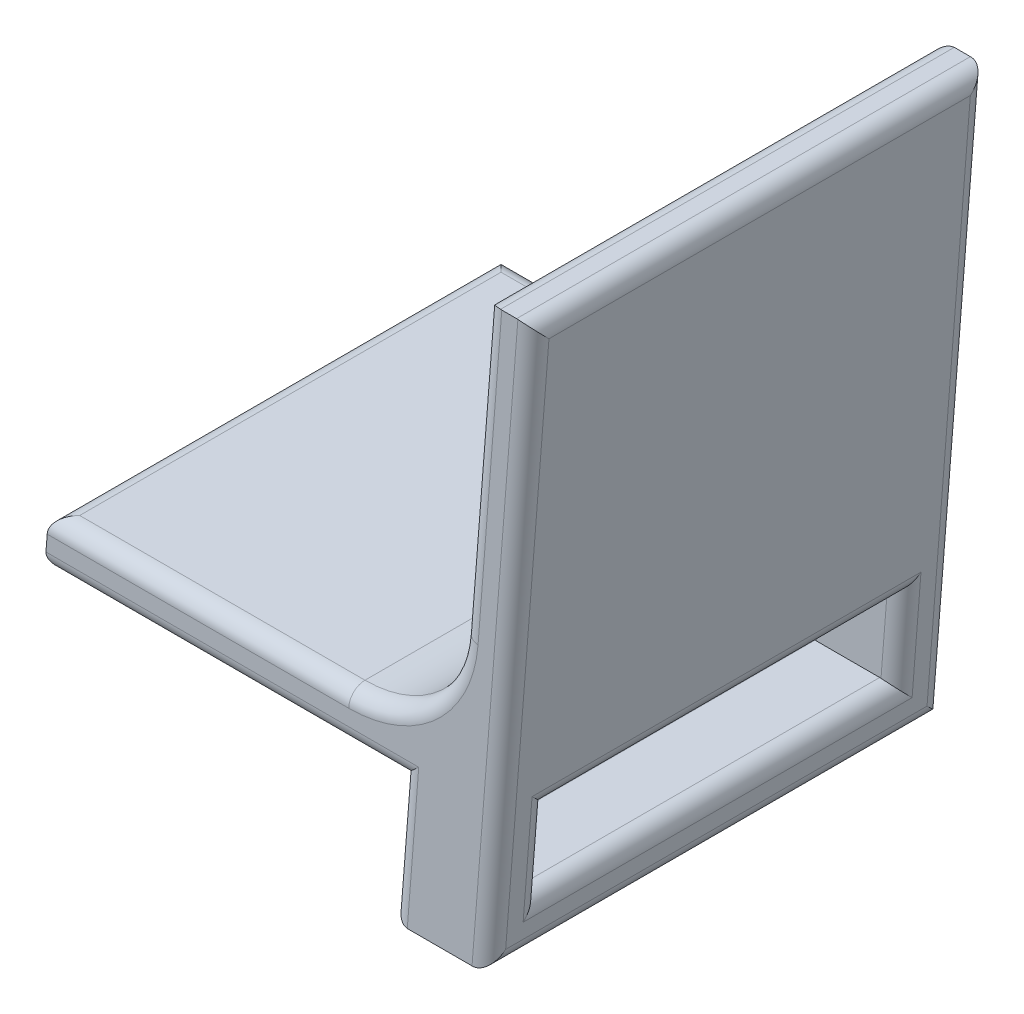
from build123d import *

# Parameters (mm, degrees)
BOSS_EXTRUDE1_DEPTH = 28
SKETCH2_W           = 22
SKETCH2_H           = 5
CUT_EXTRUDE1_DEPTH  = 48.233522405
FILLET1_R           = 7
FILLET2_R           = 1
FILLET3_R           = 1


with BuildPart() as part:
    # Sketch1 → Boss-Extrude1 (new body)
    with BuildSketch(Plane.XY):
        Polygon((0, 0), (-25, 0), (-25.235377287, -2.990752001), (-3.235377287, -2.990752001), (-3.863050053, -10.966090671), (2.136949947, -10.966090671), (3, 0), (4.967542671, 25), (1.967542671, 25), align=None)
    extrude(amount=BOSS_EXTRUDE1_DEPTH)

    # Sketch2 → Cut-Extrude1 (cut, through all, along a direction that is not the sketch's normal)
    with BuildSketch(Plane(origin=(2.981532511, -0.234651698, 0), x_dir=(0, 0, -1), z_dir=(0.9969173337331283, -0.07845909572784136, 0))):
        with Locations((-14, -5.264622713)):
            Rectangle(SKETCH2_W, SKETCH2_H)
    extrude(amount=-CUT_EXTRUDE1_DEPTH, dir=(1, 0, 0), mode=Mode.SUBTRACT)

    # Fillet1
    fillet1_edges = [part.edges().sort_by_distance(p)[0] for p in [
        (0, 0, 14),
    ]]
    fillet(fillet1_edges, radius=FILLET1_R)

    # Fillet2
    fillet2_edges = [part.edges().sort_by_distance(p)[0] for p in [
        (-3.54921367, -6.978421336, 0),
        (-14.235377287, -2.990752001, 0),
        (1.237615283, 15.725393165, 0),
        (-14.235377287, -2.990752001, 28),
        (1.967542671, 25, 14),
        (4.967542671, 25, 14),
        (2.136949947, -10.966090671, 14),
        (-3.863050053, -10.966090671, 14),
        (-25.235377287, -2.990752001, 14),
        (-25, 0, 14),
        (-3.54921367, -6.978421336, 28),
        (3.552246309, 7.016954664, 28),
        (1.237615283, 15.725393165, 28),
        (-15.735366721, 0, 0),
        (-15.735366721, 0, 28),
        (-1.719128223, 1.859742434, 0),
        (-1.719128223, 1.859742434, 28),
        (3.552246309, 7.016954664, 0),
    ]]
    fillet(fillet2_edges, radius=FILLET2_R)

    # Fillet3
    fillet3_edges = [part.edges().sort_by_distance(p)[0] for p in [
        (-3.431525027, -5.483045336, 25),
        (-3.431525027, -5.483045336, 3),
        (-3.627672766, -7.97533867, 14),
        (2.568474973, -5.483045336, 25),
        (2.372327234, -7.97533867, 14),
        (2.568474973, -5.483045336, 3),
        (2.764622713, -2.990752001, 14),
    ]]
    fillet(fillet3_edges, radius=FILLET3_R)


solid = part.part
